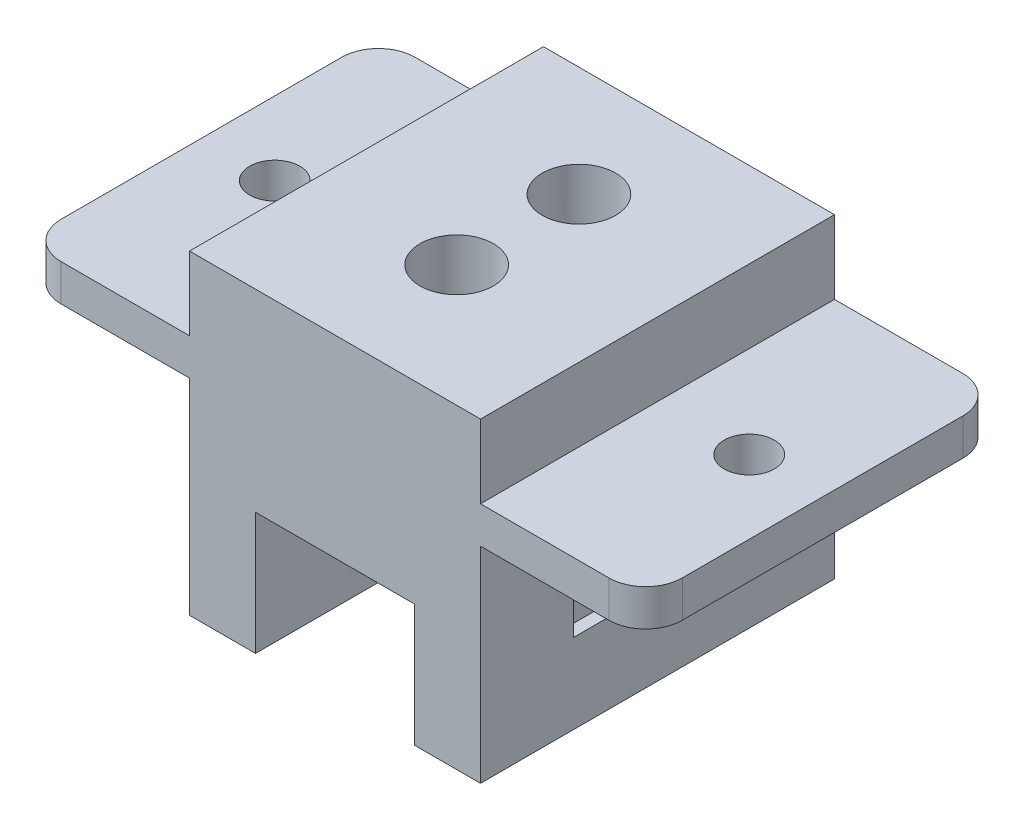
from build123d import *

# Parameters (mm, degrees)
BOSS_EXTRUDE1_DEPTH = 28.95
SKETCH2_R           = 3
CUT_EXTRUDE1_DEPTH  = 28
SKETCH3_R           = 2.05
BOSS_EXTRUDE2_DEPTH = 3
CUT_EXTRUDE2_DEPTH  = 1


with BuildPart() as part:
    # Sketch1 → Boss-Extrude1 (new body)
    with BuildSketch(Plane.XY):
        Polygon((0, 0), (0, 25.8), (23.8, 25.8), (23.8, 0), (18.4, 0), (18.4, 10), (5.4, 10), (5.4, 0), align=None)
    extrude(amount=BOSS_EXTRUDE1_DEPTH)

    # Sketch2 → Cut-Extrude1 (cut)
    with BuildSketch(Plane(origin=(0, 25.8, 0), x_dir=(1, 0, 0), z_dir=(0, 1, 0))):
        with Locations(Location((11.9, -9, 0), (0, 0, 270))):
            Circle(SKETCH2_R)
        with Locations(Location((11.9, -19, 0), (0, 0, 270))):
            Circle(SKETCH2_R)
    extrude(amount=-CUT_EXTRUDE1_DEPTH, mode=Mode.SUBTRACT)

    # Sketch3 → Boss-Extrude2 (add)
    # profile 1 of 2: a face of its own
    with BuildSketch(Plane(origin=(0, 19.8, 0), x_dir=(1, 0, 0), z_dir=(0, 1, 0))):
        with BuildLine():
            Line((0, 0), (-10.5, 0))
            ThreePointArc((-10.5, 0), (-12.621320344, -0.878679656), (-13.5, -3))
            Line((-13.5, -3), (-13.5, -25.95))
            ThreePointArc((-13.5, -25.95), (-12.621320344, -28.071320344), (-10.5, -28.95))
            Line((-10.5, -28.95), (0, -28.95))
            Line((0, -28.95), (0, 0))
        make_face()
        with Locations(Location((-7.5, -14.475, 0), (0, 0, 270))):
            Circle(SKETCH3_R, mode=Mode.SUBTRACT)
    # profile 2 of 2: a face of its own
    with BuildSketch(Plane(origin=(0, 19.8, 0), x_dir=(1, 0, 0), z_dir=(0, 1, 0))):
        with BuildLine():
            Line((34.3, -28.95), (23.8, -28.95))
            Line((23.8, -28.95), (23.8, 0))
            Line((23.8, 0), (34.3, 0))
            ThreePointArc((34.3, 0), (36.421320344, -0.878679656), (37.3, -3))
            Line((37.3, -3), (37.3, -25.95))
            ThreePointArc((37.3, -25.95), (36.421320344, -28.071320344), (34.3, -28.95))
        make_face()
        with Locations(Location((31.3, -14.475, 0), (0, 0, 90))):
            Circle(SKETCH3_R, mode=Mode.SUBTRACT)
    extrude(amount=-BOSS_EXTRUDE2_DEPTH)

    # Sketch4 → Cut-Extrude2 (cut)
    with BuildSketch(Plane.ZY):
        Polygon((11.458852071, 11.96884289), (11.458852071, 14.600870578), (6.848925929, 9.249487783), (11.458852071, 3.898104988), (11.458852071, 6.530132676), (21.338223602, 6.530132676), (21.338223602, 11.96884289), align=None)
    cut_extrude2 = extrude(amount=-CUT_EXTRUDE2_DEPTH, mode=Mode.SUBTRACT)

    # Mirror1: Cut-Extrude2 across plane
    add(cut_extrude2.mirror(Plane(origin=(11.9, 0, 0), x_dir=(0, 0, 1), z_dir=(1, 0, 0))), mode=Mode.SUBTRACT)


solid = part.part
